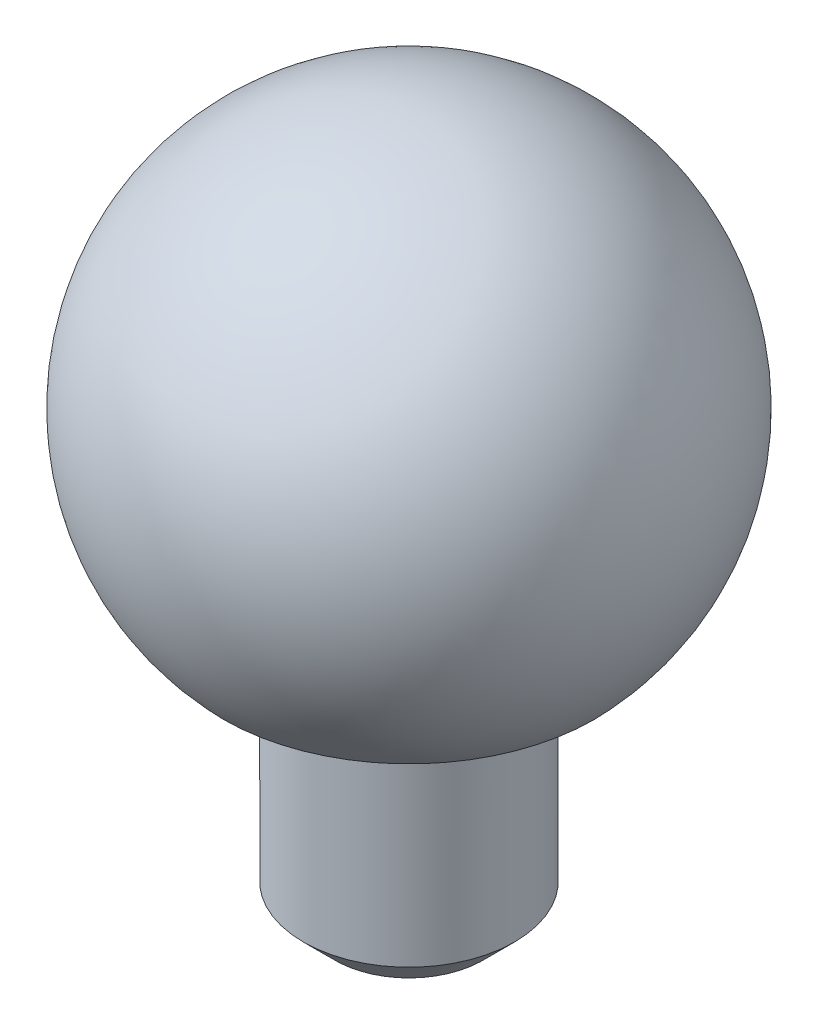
from build123d import *

# Parameters (mm, degrees)
SKIZZE2_R                       = 2
AUFSATZ_LINEAR_AUSTRAGEN1_DEPTH = 5
FASE1_SIZE                      = 0.6


with BuildPart() as part:
    # Skizze1 → Rotation1 (revolve)
    with BuildSketch(Plane(origin=(0, 0, 0), x_dir=(0, 0, -1), z_dir=(1, 0, 0))):
        with BuildLine():
            Line((0, 4.85), (0, -3.35))
            Line((0, -3.35), (3.507135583, -3.35))
            ThreePointArc((3.507135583, -3.35), (4.459260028, 1.907223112), (0, 4.85))
        make_face()
    revolve(axis=Axis((0, 21.112600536, 0), (0, -1, 0)))

    # Skizze2 → Aufsatz-Linear austragen1 (add)
    with BuildSketch(Plane.XZ.offset(3.35)):
        with Locations(Location((0, 0, 0), (0, 0, 90))):
            Circle(SKIZZE2_R)
    extrude(amount=AUFSATZ_LINEAR_AUSTRAGEN1_DEPTH)

    # Fase1
    fase1_edges = [part.edges().sort_by_distance(p)[0] for p in [
        (0, -8.35, -2),
    ]]
    chamfer(fase1_edges, length=FASE1_SIZE)


solid = part.part
